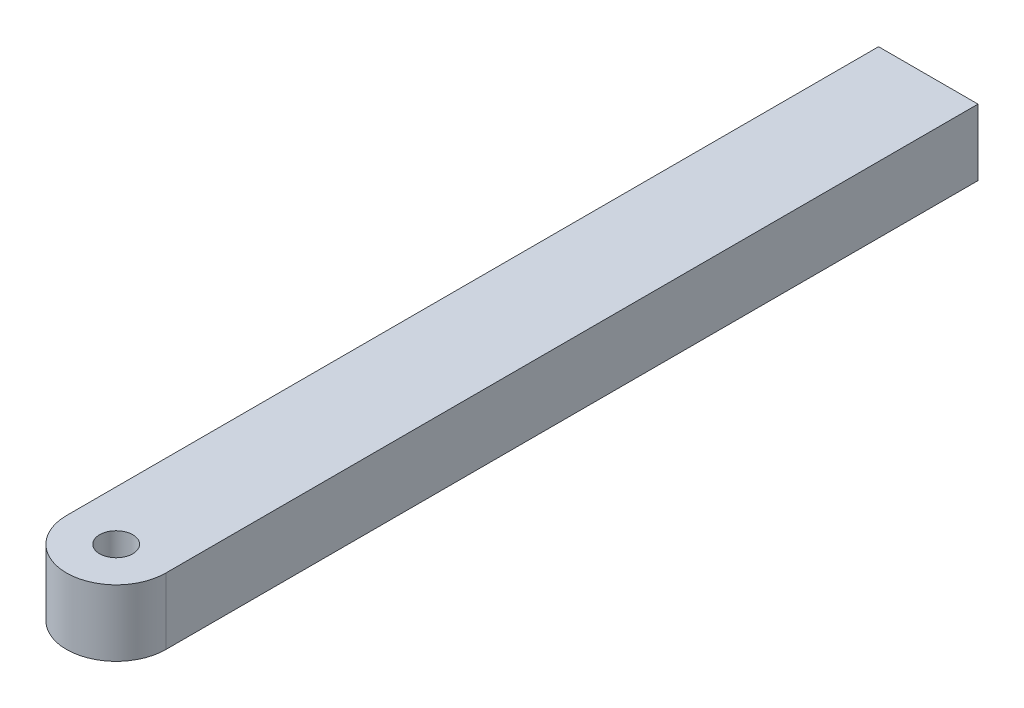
ISO-10303-21;
HEADER;
FILE_DESCRIPTION(('STEP AP214'),'2;1');
FILE_NAME('part.step','',(''),(''),'','','');
FILE_SCHEMA(('AUTOMOTIVE_DESIGN { 1 0 10303 214 1 1 1 1 }'));
ENDSEC;
DATA;
#1=APPLICATION_CONTEXT('core data for automotive mechanical design processes');
#2=APPLICATION_PROTOCOL_DEFINITION('international standard','automotive_design',2000,#1);
#3=PRODUCT_CONTEXT('',#1,'mechanical');
#4=PRODUCT('Part','Part','',(#3));
#5=PRODUCT_RELATED_PRODUCT_CATEGORY('part','',(#4));
#6=PRODUCT_DEFINITION_FORMATION('','',#4);
#7=PRODUCT_DEFINITION_CONTEXT('part definition',#1,'design');
#8=PRODUCT_DEFINITION('design','',#6,#7);
#9=PRODUCT_DEFINITION_SHAPE('','',#8);
#10=(LENGTH_UNIT() NAMED_UNIT(*) SI_UNIT(.MILLI.,.METRE.));
#11=(NAMED_UNIT(*) PLANE_ANGLE_UNIT() SI_UNIT($,.RADIAN.));
#12=(NAMED_UNIT(*) SI_UNIT($,.STERADIAN.) SOLID_ANGLE_UNIT());
#13=UNCERTAINTY_MEASURE_WITH_UNIT(LENGTH_MEASURE(1.E-05),#10,'distance_accuracy_value','');
#14=(GEOMETRIC_REPRESENTATION_CONTEXT(3) GLOBAL_UNCERTAINTY_ASSIGNED_CONTEXT((#13)) GLOBAL_UNIT_ASSIGNED_CONTEXT((#10,
#11,#12)) REPRESENTATION_CONTEXT('',''));
#15=CARTESIAN_POINT('',(0.,0.,0.));
#16=DIRECTION('',(0.,0.,1.));
#17=DIRECTION('',(1.,0.,0.));
#18=AXIS2_PLACEMENT_3D('',#15,#16,#17);
#19=CARTESIAN_POINT('',(9.525,12.7,-9.525));
#20=DIRECTION('',(0.,-1.,0.));
#21=DIRECTION('',(0.,0.,-1.));
#22=AXIS2_PLACEMENT_3D('',#19,#20,#21);
#23=CYLINDRICAL_SURFACE('',#22,9.525);
#24=CARTESIAN_POINT('',(9.525,0.,-9.525));
#25=DIRECTION('',(0.,-1.,0.));
#26=DIRECTION('',(0.,0.,-1.));
#27=AXIS2_PLACEMENT_3D('',#24,#25,#26);
#28=CIRCLE('',#27,9.525);
#29=CARTESIAN_POINT('',(19.05,0.,-9.525));
#30=VERTEX_POINT('',#29);
#31=CARTESIAN_POINT('',(0.,0.,-9.525));
#32=VERTEX_POINT('',#31);
#33=EDGE_CURVE('E66',#30,#32,#28,.T.);
#34=ORIENTED_EDGE('',*,*,#33,.F.);
#35=DIRECTION('',(0.,-1.,0.));
#36=VECTOR('',#35,1.);
#37=CARTESIAN_POINT('',(19.05,12.7,-9.525));
#38=LINE('',#37,#36);
#39=CARTESIAN_POINT('',(19.05,12.7,-9.525));
#40=VERTEX_POINT('',#39);
#41=EDGE_CURVE('E11',#40,#30,#38,.T.);
#42=ORIENTED_EDGE('',*,*,#41,.F.);
#43=CARTESIAN_POINT('',(9.525,12.7,-9.525));
#44=DIRECTION('',(0.,-1.,0.));
#45=DIRECTION('',(0.,0.,-1.));
#46=AXIS2_PLACEMENT_3D('',#43,#44,#45);
#47=CIRCLE('',#46,9.525);
#48=CARTESIAN_POINT('',(0.,12.7,-9.525));
#49=VERTEX_POINT('',#48);
#50=EDGE_CURVE('E68',#40,#49,#47,.T.);
#51=ORIENTED_EDGE('',*,*,#50,.T.);
#52=DIRECTION('',(0.,-1.,0.));
#53=VECTOR('',#52,1.);
#54=CARTESIAN_POINT('',(0.,12.7,-9.525));
#55=LINE('',#54,#53);
#56=EDGE_CURVE('E29',#49,#32,#55,.T.);
#57=ORIENTED_EDGE('',*,*,#56,.T.);
#58=EDGE_LOOP('',(#34,#42,#51,#57));
#59=FACE_BOUND('',#58,.T.);
#60=ADVANCED_FACE('F26',(#59),#23,.T.);
#61=CARTESIAN_POINT('',(19.05,12.7,-165.1));
#62=DIRECTION('',(1.,0.,0.));
#63=DIRECTION('',(0.,0.,-1.));
#64=AXIS2_PLACEMENT_3D('',#61,#62,#63);
#65=PLANE('',#64);
#66=DIRECTION('',(0.,0.,1.));
#67=VECTOR('',#66,1.);
#68=CARTESIAN_POINT('',(19.05,0.,-165.1));
#69=LINE('',#68,#67);
#70=CARTESIAN_POINT('',(19.05,0.,-165.1));
#71=VERTEX_POINT('',#70);
#72=EDGE_CURVE('E83',#71,#30,#69,.T.);
#73=ORIENTED_EDGE('',*,*,#72,.F.);
#74=DIRECTION('',(0.,-1.,0.));
#75=VECTOR('',#74,1.);
#76=CARTESIAN_POINT('',(19.05,12.7,-165.1));
#77=LINE('',#76,#75);
#78=CARTESIAN_POINT('',(19.05,12.7,-165.1));
#79=VERTEX_POINT('',#78);
#80=EDGE_CURVE('E34',#79,#71,#77,.T.);
#81=ORIENTED_EDGE('',*,*,#80,.F.);
#82=DIRECTION('',(0.,0.,1.));
#83=VECTOR('',#82,1.);
#84=CARTESIAN_POINT('',(19.05,12.7,-165.1));
#85=LINE('',#84,#83);
#86=EDGE_CURVE('E73',#79,#40,#85,.T.);
#87=ORIENTED_EDGE('',*,*,#86,.T.);
#88=ORIENTED_EDGE('',*,*,#41,.T.);
#89=EDGE_LOOP('',(#73,#81,#87,#88));
#90=FACE_BOUND('',#89,.T.);
#91=ADVANCED_FACE('F103',(#90),#65,.T.);
#92=CARTESIAN_POINT('',(0.,12.7,-165.1));
#93=DIRECTION('',(0.,0.,-1.));
#94=DIRECTION('',(-1.,0.,0.));
#95=AXIS2_PLACEMENT_3D('',#92,#93,#94);
#96=PLANE('',#95);
#97=DIRECTION('',(1.,0.,0.));
#98=VECTOR('',#97,1.);
#99=CARTESIAN_POINT('',(0.,0.,-165.1));
#100=LINE('',#99,#98);
#101=CARTESIAN_POINT('',(0.,0.,-165.1));
#102=VERTEX_POINT('',#101);
#103=EDGE_CURVE('E80',#102,#71,#100,.T.);
#104=ORIENTED_EDGE('',*,*,#103,.F.);
#105=DIRECTION('',(0.,-1.,0.));
#106=VECTOR('',#105,1.);
#107=CARTESIAN_POINT('',(0.,12.7,-165.1));
#108=LINE('',#107,#106);
#109=CARTESIAN_POINT('',(0.,12.7,-165.1));
#110=VERTEX_POINT('',#109);
#111=EDGE_CURVE('E72',#110,#102,#108,.T.);
#112=ORIENTED_EDGE('',*,*,#111,.F.);
#113=DIRECTION('',(1.,0.,0.));
#114=VECTOR('',#113,1.);
#115=CARTESIAN_POINT('',(0.,12.7,-165.1));
#116=LINE('',#115,#114);
#117=EDGE_CURVE('E96',#110,#79,#116,.T.);
#118=ORIENTED_EDGE('',*,*,#117,.T.);
#119=ORIENTED_EDGE('',*,*,#80,.T.);
#120=EDGE_LOOP('',(#104,#112,#118,#119));
#121=FACE_BOUND('',#120,.T.);
#122=ADVANCED_FACE('F100',(#121),#96,.T.);
#123=CARTESIAN_POINT('',(0.,12.7,-9.525));
#124=DIRECTION('',(-1.,0.,0.));
#125=DIRECTION('',(0.,0.,1.));
#126=AXIS2_PLACEMENT_3D('',#123,#124,#125);
#127=PLANE('',#126);
#128=DIRECTION('',(0.,0.,-1.));
#129=VECTOR('',#128,1.);
#130=CARTESIAN_POINT('',(0.,0.,-9.525));
#131=LINE('',#130,#129);
#132=EDGE_CURVE('E75',#32,#102,#131,.T.);
#133=ORIENTED_EDGE('',*,*,#132,.F.);
#134=ORIENTED_EDGE('',*,*,#56,.F.);
#135=DIRECTION('',(0.,0.,-1.));
#136=VECTOR('',#135,1.);
#137=CARTESIAN_POINT('',(0.,12.7,-9.525));
#138=LINE('',#137,#136);
#139=EDGE_CURVE('E94',#49,#110,#138,.T.);
#140=ORIENTED_EDGE('',*,*,#139,.T.);
#141=ORIENTED_EDGE('',*,*,#111,.T.);
#142=EDGE_LOOP('',(#133,#134,#140,#141));
#143=FACE_BOUND('',#142,.T.);
#144=ADVANCED_FACE('F76',(#143),#127,.T.);
#145=CARTESIAN_POINT('',(9.525,12.7,-9.525));
#146=DIRECTION('',(0.,-1.,0.));
#147=DIRECTION('',(0.,0.,-1.));
#148=AXIS2_PLACEMENT_3D('',#145,#146,#147);
#149=PLANE('',#148);
#150=CARTESIAN_POINT('',(9.525,12.7,-9.525));
#151=DIRECTION('',(0.,-1.,0.));
#152=DIRECTION('',(0.,0.,1.));
#153=AXIS2_PLACEMENT_3D('',#150,#151,#152);
#154=CIRCLE('',#153,3.175);
#155=CARTESIAN_POINT('',(9.525,12.7,-6.35));
#156=VERTEX_POINT('',#155);
#157=EDGE_CURVE('E84',#156,#156,#154,.T.);
#158=ORIENTED_EDGE('',*,*,#157,.T.);
#159=EDGE_LOOP('',(#158));
#160=FACE_BOUND('',#159,.T.);
#161=ORIENTED_EDGE('',*,*,#50,.F.);
#162=ORIENTED_EDGE('',*,*,#86,.F.);
#163=ORIENTED_EDGE('',*,*,#117,.F.);
#164=ORIENTED_EDGE('',*,*,#139,.F.);
#165=EDGE_LOOP('',(#161,#162,#163,#164));
#166=FACE_BOUND('',#165,.T.);
#167=ADVANCED_FACE('F105',(#160,#166),#149,.F.);
#168=CARTESIAN_POINT('',(9.525,0.,-9.525));
#169=DIRECTION('',(0.,-1.,0.));
#170=DIRECTION('',(0.,0.,-1.));
#171=AXIS2_PLACEMENT_3D('',#168,#169,#170);
#172=PLANE('',#171);
#173=CARTESIAN_POINT('',(9.525,0.,-9.525));
#174=DIRECTION('',(0.,-1.,0.));
#175=DIRECTION('',(0.,0.,1.));
#176=AXIS2_PLACEMENT_3D('',#173,#174,#175);
#177=CIRCLE('',#176,3.175);
#178=CARTESIAN_POINT('',(9.525,0.,-6.35));
#179=VERTEX_POINT('',#178);
#180=EDGE_CURVE('E87',#179,#179,#177,.T.);
#181=ORIENTED_EDGE('',*,*,#180,.F.);
#182=EDGE_LOOP('',(#181));
#183=FACE_BOUND('',#182,.T.);
#184=ORIENTED_EDGE('',*,*,#33,.T.);
#185=ORIENTED_EDGE('',*,*,#132,.T.);
#186=ORIENTED_EDGE('',*,*,#103,.T.);
#187=ORIENTED_EDGE('',*,*,#72,.T.);
#188=EDGE_LOOP('',(#184,#185,#186,#187));
#189=FACE_BOUND('',#188,.T.);
#190=ADVANCED_FACE('F82',(#183,#189),#172,.T.);
#191=CARTESIAN_POINT('',(9.525,12.7,-9.525));
#192=DIRECTION('',(0.,-1.,0.));
#193=DIRECTION('',(0.,0.,-1.));
#194=AXIS2_PLACEMENT_3D('',#191,#192,#193);
#195=CYLINDRICAL_SURFACE('',#194,3.175);
#196=ORIENTED_EDGE('',*,*,#157,.F.);
#197=EDGE_LOOP('',(#196));
#198=FACE_BOUND('',#197,.T.);
#199=ORIENTED_EDGE('',*,*,#180,.T.);
#200=EDGE_LOOP('',(#199));
#201=FACE_BOUND('',#200,.T.);
#202=ADVANCED_FACE('F113',(#198,#201),#195,.F.);
#203=CLOSED_SHELL('',(#60,#91,#122,#144,#167,#190,#202));
#204=MANIFOLD_SOLID_BREP('B2',#203);
#205=ADVANCED_BREP_SHAPE_REPRESENTATION('',(#18,#204),#14);
#206=SHAPE_DEFINITION_REPRESENTATION(#9,#205);
ENDSEC;
END-ISO-10303-21;
